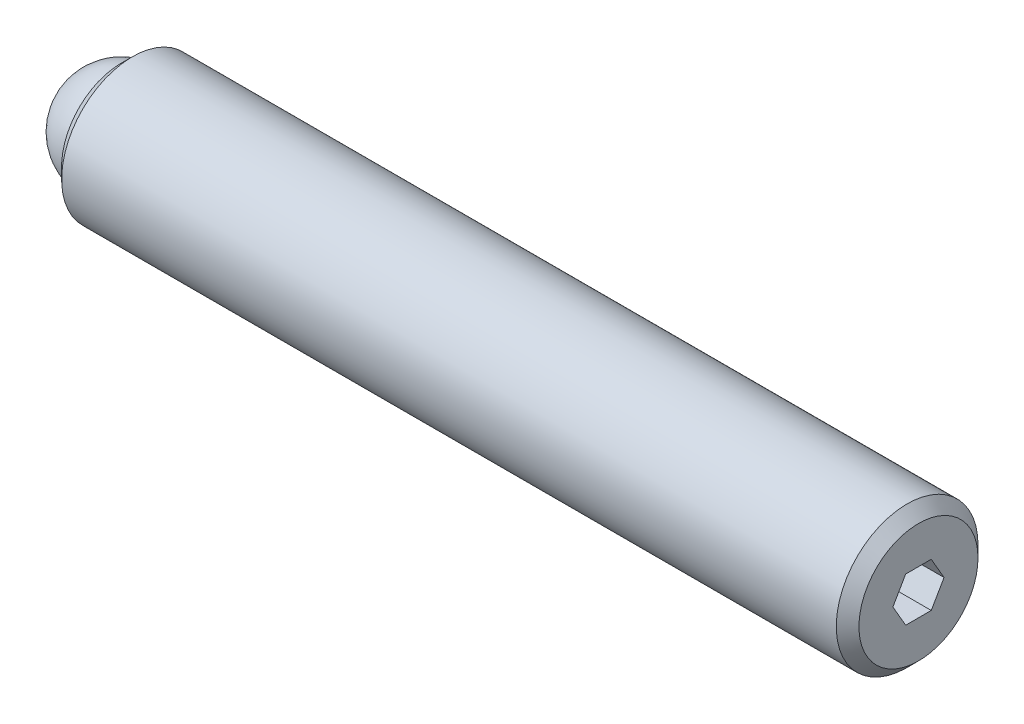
ISO-10303-21;
HEADER;
FILE_DESCRIPTION(('STEP AP214'),'2;1');
FILE_NAME('part.step','',(''),(''),'','','');
FILE_SCHEMA(('AUTOMOTIVE_DESIGN { 1 0 10303 214 1 1 1 1 }'));
ENDSEC;
DATA;
#1=APPLICATION_CONTEXT('core data for automotive mechanical design processes');
#2=APPLICATION_PROTOCOL_DEFINITION('international standard','automotive_design',2000,#1);
#3=PRODUCT_CONTEXT('',#1,'mechanical');
#4=PRODUCT('Part','Part','',(#3));
#5=PRODUCT_RELATED_PRODUCT_CATEGORY('part','',(#4));
#6=PRODUCT_DEFINITION_FORMATION('','',#4);
#7=PRODUCT_DEFINITION_CONTEXT('part definition',#1,'design');
#8=PRODUCT_DEFINITION('design','',#6,#7);
#9=PRODUCT_DEFINITION_SHAPE('','',#8);
#10=(LENGTH_UNIT() NAMED_UNIT(*) SI_UNIT(.MILLI.,.METRE.));
#11=(NAMED_UNIT(*) PLANE_ANGLE_UNIT() SI_UNIT($,.RADIAN.));
#12=(NAMED_UNIT(*) SI_UNIT($,.STERADIAN.) SOLID_ANGLE_UNIT());
#13=UNCERTAINTY_MEASURE_WITH_UNIT(LENGTH_MEASURE(1.E-05),#10,'distance_accuracy_value','');
#14=(GEOMETRIC_REPRESENTATION_CONTEXT(3) GLOBAL_UNCERTAINTY_ASSIGNED_CONTEXT((#13)) GLOBAL_UNIT_ASSIGNED_CONTEXT((#10,
#11,#12)) REPRESENTATION_CONTEXT('',''));
#15=CARTESIAN_POINT('',(0.,0.,0.));
#16=DIRECTION('',(0.,0.,1.));
#17=DIRECTION('',(1.,0.,0.));
#18=AXIS2_PLACEMENT_3D('',#15,#16,#17);
#19=CARTESIAN_POINT('',(0.,0.,0.));
#20=DIRECTION('',(0.,-1.,0.));
#21=DIRECTION('',(0.,0.,1.));
#22=AXIS2_PLACEMENT_3D('',#19,#20,#21);
#23=SPHERICAL_SURFACE('',#22,2.38125);
#24=CARTESIAN_POINT('',(0.,-2.38125,0.));
#25=VERTEX_POINT('',#24);
#26=VERTEX_LOOP('',#25);
#27=FACE_BOUND('',#26,.T.);
#28=ADVANCED_FACE('F41',(#27),#23,.T.);
#29=CLOSED_SHELL('',(#28));
#30=MANIFOLD_SOLID_BREP('B2',#29);
#31=CARTESIAN_POINT('',(35.71875,0.,0.));
#32=DIRECTION('',(-1.,0.,0.));
#33=DIRECTION('',(0.,0.,1.));
#34=AXIS2_PLACEMENT_3D('',#31,#32,#33);
#35=CYLINDRICAL_SURFACE('',#34,3.175);
#36=CARTESIAN_POINT('',(35.21075,0.,0.));
#37=DIRECTION('',(1.,0.,0.));
#38=DIRECTION('',(0.,0.,-1.));
#39=AXIS2_PLACEMENT_3D('',#36,#37,#38);
#40=CIRCLE('',#39,3.175);
#41=CARTESIAN_POINT('',(35.21075,0.,-3.175));
#42=VERTEX_POINT('',#41);
#43=EDGE_CURVE('E39',#42,#42,#40,.F.);
#44=ORIENTED_EDGE('',*,*,#43,.T.);
#45=EDGE_LOOP('',(#44));
#46=FACE_BOUND('',#45,.T.);
#47=CARTESIAN_POINT('',(0.508000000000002,0.,0.));
#48=DIRECTION('',(1.,0.,0.));
#49=DIRECTION('',(0.,0.,-1.));
#50=AXIS2_PLACEMENT_3D('',#47,#48,#49);
#51=CIRCLE('',#50,3.175);
#52=CARTESIAN_POINT('',(0.508000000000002,0.,-3.175));
#53=VERTEX_POINT('',#52);
#54=EDGE_CURVE('E176',#53,#53,#51,.T.);
#55=ORIENTED_EDGE('',*,*,#54,.T.);
#56=EDGE_LOOP('',(#55));
#57=FACE_BOUND('',#56,.T.);
#58=ADVANCED_FACE('F54',(#46,#57),#35,.T.);
#59=CARTESIAN_POINT('',(35.71875,0.,0.));
#60=DIRECTION('',(1.,0.,0.));
#61=DIRECTION('',(0.,0.,-1.));
#62=AXIS2_PLACEMENT_3D('',#59,#60,#61);
#63=PLANE('',#62);
#64=DIRECTION('',(0.,0.866025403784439,-0.5));
#65=VECTOR('',#64,1.);
#66=CARTESIAN_POINT('',(35.71875,-0.9921875,-0.572839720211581));
#67=LINE('',#66,#65);
#68=CARTESIAN_POINT('',(35.71875,-0.9921875,-0.572839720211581));
#69=VERTEX_POINT('',#68);
#70=CARTESIAN_POINT('',(35.71875,0.,-1.14567944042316));
#71=VERTEX_POINT('',#70);
#72=EDGE_CURVE('E77',#69,#71,#67,.T.);
#73=ORIENTED_EDGE('',*,*,#72,.F.);
#74=DIRECTION('',(0.,0.,-1.));
#75=VECTOR('',#74,1.);
#76=CARTESIAN_POINT('',(35.71875,-0.9921875,0.572839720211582));
#77=LINE('',#76,#75);
#78=CARTESIAN_POINT('',(35.71875,-0.9921875,0.572839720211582));
#79=VERTEX_POINT('',#78);
#80=EDGE_CURVE('E143',#79,#69,#77,.T.);
#81=ORIENTED_EDGE('',*,*,#80,.F.);
#82=DIRECTION('',(0.,-0.866025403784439,-0.5));
#83=VECTOR('',#82,1.);
#84=CARTESIAN_POINT('',(35.71875,0.,1.14567944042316));
#85=LINE('',#84,#83);
#86=CARTESIAN_POINT('',(35.71875,0.,1.14567944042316));
#87=VERTEX_POINT('',#86);
#88=EDGE_CURVE('E169',#87,#79,#85,.T.);
#89=ORIENTED_EDGE('',*,*,#88,.F.);
#90=DIRECTION('',(0.,-0.866025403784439,0.5));
#91=VECTOR('',#90,1.);
#92=CARTESIAN_POINT('',(35.71875,0.992187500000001,0.572839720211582));
#93=LINE('',#92,#91);
#94=CARTESIAN_POINT('',(35.71875,0.992187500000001,0.572839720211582));
#95=VERTEX_POINT('',#94);
#96=EDGE_CURVE('E166',#95,#87,#93,.T.);
#97=ORIENTED_EDGE('',*,*,#96,.F.);
#98=DIRECTION('',(0.,0.,1.));
#99=VECTOR('',#98,1.);
#100=CARTESIAN_POINT('',(35.71875,0.9921875,-0.572839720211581));
#101=LINE('',#100,#99);
#102=CARTESIAN_POINT('',(35.71875,0.9921875,-0.572839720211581));
#103=VERTEX_POINT('',#102);
#104=EDGE_CURVE('E163',#103,#95,#101,.T.);
#105=ORIENTED_EDGE('',*,*,#104,.F.);
#106=DIRECTION('',(0.,0.866025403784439,0.5));
#107=VECTOR('',#106,1.);
#108=CARTESIAN_POINT('',(35.71875,0.,-1.14567944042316));
#109=LINE('',#108,#107);
#110=EDGE_CURVE('E160',#71,#103,#109,.T.);
#111=ORIENTED_EDGE('',*,*,#110,.F.);
#112=EDGE_LOOP('',(#73,#81,#89,#97,#105,#111));
#113=FACE_BOUND('',#112,.T.);
#114=CARTESIAN_POINT('',(35.71875,0.,0.));
#115=DIRECTION('',(1.,0.,0.));
#116=DIRECTION('',(0.,0.,-1.));
#117=AXIS2_PLACEMENT_3D('',#114,#115,#116);
#118=CIRCLE('',#117,2.66699999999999);
#119=CARTESIAN_POINT('',(35.71875,0.,-2.66699999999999));
#120=VERTEX_POINT('',#119);
#121=EDGE_CURVE('E62',#120,#120,#118,.T.);
#122=ORIENTED_EDGE('',*,*,#121,.T.);
#123=EDGE_LOOP('',(#122));
#124=FACE_BOUND('',#123,.T.);
#125=ADVANCED_FACE('F193',(#113,#124),#63,.T.);
#126=CARTESIAN_POINT('',(0.,0.,0.));
#127=DIRECTION('',(1.,0.,0.));
#128=DIRECTION('',(0.,0.,-1.));
#129=AXIS2_PLACEMENT_3D('',#126,#127,#128);
#130=PLANE('',#129);
#131=CARTESIAN_POINT('',(0.,0.,0.));
#132=DIRECTION('',(-1.,0.,0.));
#133=DIRECTION('',(0.,0.,1.));
#134=AXIS2_PLACEMENT_3D('',#131,#132,#133);
#135=CIRCLE('',#134,2.38125);
#136=CARTESIAN_POINT('',(0.,2.38040333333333,-0.0634943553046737));
#137=VERTEX_POINT('',#136);
#138=CARTESIAN_POINT('',(0.,2.38040333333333,0.0634943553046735));
#139=VERTEX_POINT('',#138);
#140=EDGE_CURVE('E128',#137,#139,#135,.T.);
#141=ORIENTED_EDGE('',*,*,#140,.F.);
#142=CARTESIAN_POINT('',(0.,2.38125,0.));
#143=DIRECTION('',(-1.,0.,0.));
#144=DIRECTION('',(0.,0.,1.));
#145=AXIS2_PLACEMENT_3D('',#142,#143,#144);
#146=CIRCLE('',#145,0.0635000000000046);
#147=EDGE_CURVE('E117',#139,#137,#146,.T.);
#148=ORIENTED_EDGE('',*,*,#147,.F.);
#149=EDGE_LOOP('',(#141,#148));
#150=FACE_BOUND('',#149,.T.);
#151=CARTESIAN_POINT('',(0.,0.,0.));
#152=DIRECTION('',(1.,0.,0.));
#153=DIRECTION('',(0.,0.,-1.));
#154=AXIS2_PLACEMENT_3D('',#151,#152,#153);
#155=CIRCLE('',#154,2.667);
#156=CARTESIAN_POINT('',(0.,0.,-2.667));
#157=VERTEX_POINT('',#156);
#158=EDGE_CURVE('E188',#157,#157,#155,.F.);
#159=ORIENTED_EDGE('',*,*,#158,.T.);
#160=EDGE_LOOP('',(#159));
#161=FACE_BOUND('',#160,.T.);
#162=ADVANCED_FACE('F132',(#150,#161),#130,.F.);
#163=CARTESIAN_POINT('',(0.508000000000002,0.,0.));
#164=DIRECTION('',(1.,0.,0.));
#165=DIRECTION('',(0.,0.,-1.));
#166=AXIS2_PLACEMENT_3D('',#163,#164,#165);
#167=CONICAL_SURFACE('',#166,3.175,0.785398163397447);
#168=ORIENTED_EDGE('',*,*,#158,.F.);
#169=EDGE_LOOP('',(#168));
#170=FACE_BOUND('',#169,.T.);
#171=ORIENTED_EDGE('',*,*,#54,.F.);
#172=EDGE_LOOP('',(#171));
#173=FACE_BOUND('',#172,.T.);
#174=ADVANCED_FACE('F197',(#170,#173),#167,.T.);
#175=CARTESIAN_POINT('',(35.71875,0.,0.));
#176=DIRECTION('',(-1.,0.,0.));
#177=DIRECTION('',(0.,0.,1.));
#178=AXIS2_PLACEMENT_3D('',#175,#176,#177);
#179=CONICAL_SURFACE('',#178,2.66699999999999,0.785398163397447);
#180=ORIENTED_EDGE('',*,*,#43,.F.);
#181=EDGE_LOOP('',(#180));
#182=FACE_BOUND('',#181,.T.);
#183=ORIENTED_EDGE('',*,*,#121,.F.);
#184=EDGE_LOOP('',(#183));
#185=FACE_BOUND('',#184,.T.);
#186=ADVANCED_FACE('F56',(#182,#185),#179,.T.);
#187=CARTESIAN_POINT('',(33.43275,-0.9921875,-0.572839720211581));
#188=DIRECTION('',(0.,-0.5,-0.866025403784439));
#189=DIRECTION('',(0.,0.866025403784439,-0.5));
#190=AXIS2_PLACEMENT_3D('',#187,#188,#189);
#191=PLANE('',#190);
#192=ORIENTED_EDGE('',*,*,#72,.T.);
#193=DIRECTION('',(1.,0.,0.));
#194=VECTOR('',#193,1.);
#195=CARTESIAN_POINT('',(33.43275,0.,-1.14567944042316));
#196=LINE('',#195,#194);
#197=CARTESIAN_POINT('',(33.43275,0.,-1.14567944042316));
#198=VERTEX_POINT('',#197);
#199=EDGE_CURVE('E158',#198,#71,#196,.T.);
#200=ORIENTED_EDGE('',*,*,#199,.F.);
#201=DIRECTION('',(0.,0.866025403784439,-0.5));
#202=VECTOR('',#201,1.);
#203=CARTESIAN_POINT('',(33.43275,-0.9921875,-0.572839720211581));
#204=LINE('',#203,#202);
#205=CARTESIAN_POINT('',(33.43275,-0.9921875,-0.572839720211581));
#206=VERTEX_POINT('',#205);
#207=EDGE_CURVE('E139',#206,#198,#204,.T.);
#208=ORIENTED_EDGE('',*,*,#207,.F.);
#209=DIRECTION('',(1.,0.,0.));
#210=VECTOR('',#209,1.);
#211=CARTESIAN_POINT('',(33.43275,-0.9921875,-0.572839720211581));
#212=LINE('',#211,#210);
#213=EDGE_CURVE('E174',#206,#69,#212,.T.);
#214=ORIENTED_EDGE('',*,*,#213,.T.);
#215=EDGE_LOOP('',(#192,#200,#208,#214));
#216=FACE_BOUND('',#215,.T.);
#217=ADVANCED_FACE('F196',(#216),#191,.F.);
#218=CARTESIAN_POINT('',(33.43275,-0.9921875,0.572839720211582));
#219=DIRECTION('',(0.,-1.,0.));
#220=DIRECTION('',(0.,0.,-1.));
#221=AXIS2_PLACEMENT_3D('',#218,#219,#220);
#222=PLANE('',#221);
#223=ORIENTED_EDGE('',*,*,#80,.T.);
#224=ORIENTED_EDGE('',*,*,#213,.F.);
#225=DIRECTION('',(0.,0.,-1.));
#226=VECTOR('',#225,1.);
#227=CARTESIAN_POINT('',(33.43275,-0.9921875,0.572839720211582));
#228=LINE('',#227,#226);
#229=CARTESIAN_POINT('',(33.43275,-0.9921875,0.572839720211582));
#230=VERTEX_POINT('',#229);
#231=EDGE_CURVE('E155',#230,#206,#228,.T.);
#232=ORIENTED_EDGE('',*,*,#231,.F.);
#233=DIRECTION('',(1.,0.,0.));
#234=VECTOR('',#233,1.);
#235=CARTESIAN_POINT('',(33.43275,-0.9921875,0.572839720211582));
#236=LINE('',#235,#234);
#237=EDGE_CURVE('E177',#230,#79,#236,.T.);
#238=ORIENTED_EDGE('',*,*,#237,.T.);
#239=EDGE_LOOP('',(#223,#224,#232,#238));
#240=FACE_BOUND('',#239,.T.);
#241=ADVANCED_FACE('F203',(#240),#222,.F.);
#242=CARTESIAN_POINT('',(33.43275,0.,1.14567944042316));
#243=DIRECTION('',(0.,-0.5,0.866025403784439));
#244=DIRECTION('',(0.,-0.866025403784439,-0.5));
#245=AXIS2_PLACEMENT_3D('',#242,#243,#244);
#246=PLANE('',#245);
#247=ORIENTED_EDGE('',*,*,#88,.T.);
#248=ORIENTED_EDGE('',*,*,#237,.F.);
#249=DIRECTION('',(0.,-0.866025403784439,-0.5));
#250=VECTOR('',#249,1.);
#251=CARTESIAN_POINT('',(33.43275,0.,1.14567944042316));
#252=LINE('',#251,#250);
#253=CARTESIAN_POINT('',(33.43275,0.,1.14567944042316));
#254=VERTEX_POINT('',#253);
#255=EDGE_CURVE('E152',#254,#230,#252,.T.);
#256=ORIENTED_EDGE('',*,*,#255,.F.);
#257=DIRECTION('',(1.,0.,0.));
#258=VECTOR('',#257,1.);
#259=CARTESIAN_POINT('',(33.43275,0.,1.14567944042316));
#260=LINE('',#259,#258);
#261=EDGE_CURVE('E179',#254,#87,#260,.T.);
#262=ORIENTED_EDGE('',*,*,#261,.T.);
#263=EDGE_LOOP('',(#247,#248,#256,#262));
#264=FACE_BOUND('',#263,.T.);
#265=ADVANCED_FACE('F231',(#264),#246,.F.);
#266=CARTESIAN_POINT('',(33.43275,0.992187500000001,0.572839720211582));
#267=DIRECTION('',(0.,0.5,0.866025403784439));
#268=DIRECTION('',(0.,-0.866025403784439,0.5));
#269=AXIS2_PLACEMENT_3D('',#266,#267,#268);
#270=PLANE('',#269);
#271=ORIENTED_EDGE('',*,*,#96,.T.);
#272=ORIENTED_EDGE('',*,*,#261,.F.);
#273=DIRECTION('',(0.,-0.866025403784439,0.5));
#274=VECTOR('',#273,1.);
#275=CARTESIAN_POINT('',(33.43275,0.992187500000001,0.572839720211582));
#276=LINE('',#275,#274);
#277=CARTESIAN_POINT('',(33.43275,0.992187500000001,0.572839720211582));
#278=VERTEX_POINT('',#277);
#279=EDGE_CURVE('E149',#278,#254,#276,.T.);
#280=ORIENTED_EDGE('',*,*,#279,.F.);
#281=DIRECTION('',(1.,0.,0.));
#282=VECTOR('',#281,1.);
#283=CARTESIAN_POINT('',(33.43275,0.992187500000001,0.572839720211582));
#284=LINE('',#283,#282);
#285=EDGE_CURVE('E181',#278,#95,#284,.T.);
#286=ORIENTED_EDGE('',*,*,#285,.T.);
#287=EDGE_LOOP('',(#271,#272,#280,#286));
#288=FACE_BOUND('',#287,.T.);
#289=ADVANCED_FACE('F227',(#288),#270,.F.);
#290=CARTESIAN_POINT('',(33.43275,0.9921875,-0.572839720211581));
#291=DIRECTION('',(0.,1.,0.));
#292=DIRECTION('',(0.,0.,1.));
#293=AXIS2_PLACEMENT_3D('',#290,#291,#292);
#294=PLANE('',#293);
#295=ORIENTED_EDGE('',*,*,#104,.T.);
#296=ORIENTED_EDGE('',*,*,#285,.F.);
#297=DIRECTION('',(0.,0.,1.));
#298=VECTOR('',#297,1.);
#299=CARTESIAN_POINT('',(33.43275,0.9921875,-0.572839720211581));
#300=LINE('',#299,#298);
#301=CARTESIAN_POINT('',(33.43275,0.9921875,-0.572839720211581));
#302=VERTEX_POINT('',#301);
#303=EDGE_CURVE('E146',#302,#278,#300,.T.);
#304=ORIENTED_EDGE('',*,*,#303,.F.);
#305=DIRECTION('',(1.,0.,0.));
#306=VECTOR('',#305,1.);
#307=CARTESIAN_POINT('',(33.43275,0.9921875,-0.572839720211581));
#308=LINE('',#307,#306);
#309=EDGE_CURVE('E183',#302,#103,#308,.T.);
#310=ORIENTED_EDGE('',*,*,#309,.T.);
#311=EDGE_LOOP('',(#295,#296,#304,#310));
#312=FACE_BOUND('',#311,.T.);
#313=ADVANCED_FACE('F223',(#312),#294,.F.);
#314=CARTESIAN_POINT('',(33.43275,0.,-1.14567944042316));
#315=DIRECTION('',(0.,0.5,-0.866025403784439));
#316=DIRECTION('',(0.,0.866025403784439,0.5));
#317=AXIS2_PLACEMENT_3D('',#314,#315,#316);
#318=PLANE('',#317);
#319=ORIENTED_EDGE('',*,*,#110,.T.);
#320=ORIENTED_EDGE('',*,*,#309,.F.);
#321=DIRECTION('',(0.,0.866025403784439,0.5));
#322=VECTOR('',#321,1.);
#323=CARTESIAN_POINT('',(33.43275,0.,-1.14567944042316));
#324=LINE('',#323,#322);
#325=EDGE_CURVE('E142',#198,#302,#324,.T.);
#326=ORIENTED_EDGE('',*,*,#325,.F.);
#327=ORIENTED_EDGE('',*,*,#199,.T.);
#328=EDGE_LOOP('',(#319,#320,#326,#327));
#329=FACE_BOUND('',#328,.T.);
#330=ADVANCED_FACE('F219',(#329),#318,.F.);
#331=CARTESIAN_POINT('',(33.43275,0.,0.));
#332=DIRECTION('',(1.,0.,0.));
#333=DIRECTION('',(0.,0.,-1.));
#334=AXIS2_PLACEMENT_3D('',#331,#332,#333);
#335=PLANE('',#334);
#336=ORIENTED_EDGE('',*,*,#207,.T.);
#337=ORIENTED_EDGE('',*,*,#325,.T.);
#338=ORIENTED_EDGE('',*,*,#303,.T.);
#339=ORIENTED_EDGE('',*,*,#279,.T.);
#340=ORIENTED_EDGE('',*,*,#255,.T.);
#341=ORIENTED_EDGE('',*,*,#231,.T.);
#342=EDGE_LOOP('',(#336,#337,#338,#339,#340,#341));
#343=FACE_BOUND('',#342,.T.);
#344=ADVANCED_FACE('F222',(#343),#335,.T.);
#345=CARTESIAN_POINT('',(2.38125,0.,0.));
#346=DIRECTION('',(-1.,0.,0.));
#347=DIRECTION('',(0.,0.,1.));
#348=AXIS2_PLACEMENT_3D('',#345,#346,#347);
#349=CYLINDRICAL_SURFACE('',#348,2.38125);
#350=CARTESIAN_POINT('',(2.38125,0.,0.));
#351=DIRECTION('',(-1.,0.,0.));
#352=DIRECTION('',(0.,0.,1.));
#353=AXIS2_PLACEMENT_3D('',#350,#351,#352);
#354=CIRCLE('',#353,2.38125);
#355=CARTESIAN_POINT('',(2.38125,2.38040333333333,-0.0634943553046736));
#356=VERTEX_POINT('',#355);
#357=CARTESIAN_POINT('',(2.38125,2.38040333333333,0.0634943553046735));
#358=VERTEX_POINT('',#357);
#359=EDGE_CURVE('E130',#356,#358,#354,.T.);
#360=ORIENTED_EDGE('',*,*,#359,.F.);
#361=DIRECTION('',(-1.,0.,0.));
#362=VECTOR('',#361,1.);
#363=CARTESIAN_POINT('',(2.52362097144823,2.38040333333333,-0.0634943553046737));
#364=LINE('',#363,#362);
#365=EDGE_CURVE('E69',#356,#137,#364,.T.);
#366=ORIENTED_EDGE('',*,*,#365,.T.);
#367=ORIENTED_EDGE('',*,*,#140,.T.);
#368=DIRECTION('',(-1.,0.,0.));
#369=VECTOR('',#368,1.);
#370=CARTESIAN_POINT('',(2.52362097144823,2.38040333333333,0.0634943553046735));
#371=LINE('',#370,#369);
#372=EDGE_CURVE('E120',#358,#139,#371,.T.);
#373=ORIENTED_EDGE('',*,*,#372,.F.);
#374=EDGE_LOOP('',(#360,#366,#367,#373));
#375=FACE_BOUND('',#374,.T.);
#376=ADVANCED_FACE('F127',(#375),#349,.F.);
#377=CARTESIAN_POINT('',(2.38125,0.,0.));
#378=DIRECTION('',(-1.,0.,0.));
#379=DIRECTION('',(0.,0.,1.));
#380=AXIS2_PLACEMENT_3D('',#377,#378,#379);
#381=PLANE('',#380);
#382=ORIENTED_EDGE('',*,*,#359,.T.);
#383=CARTESIAN_POINT('',(2.38125,2.38125,0.));
#384=DIRECTION('',(-1.,0.,0.));
#385=DIRECTION('',(0.,0.,1.));
#386=AXIS2_PLACEMENT_3D('',#383,#384,#385);
#387=CIRCLE('',#386,0.0635000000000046);
#388=EDGE_CURVE('E134',#356,#358,#387,.F.);
#389=ORIENTED_EDGE('',*,*,#388,.F.);
#390=EDGE_LOOP('',(#382,#389));
#391=FACE_BOUND('',#390,.T.);
#392=ADVANCED_FACE('F244',(#391),#381,.T.);
#393=CARTESIAN_POINT('',(2.52362097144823,2.38125,0.));
#394=DIRECTION('',(-1.,0.,0.));
#395=DIRECTION('',(0.,0.,1.));
#396=AXIS2_PLACEMENT_3D('',#393,#394,#395);
#397=CYLINDRICAL_SURFACE('',#396,0.0635000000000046);
#398=ORIENTED_EDGE('',*,*,#388,.T.);
#399=ORIENTED_EDGE('',*,*,#372,.T.);
#400=ORIENTED_EDGE('',*,*,#147,.T.);
#401=ORIENTED_EDGE('',*,*,#365,.F.);
#402=EDGE_LOOP('',(#398,#399,#400,#401));
#403=FACE_BOUND('',#402,.T.);
#404=ADVANCED_FACE('F118',(#403),#397,.F.);
#405=CLOSED_SHELL('',(#58,#125,#162,#174,#186,#217,#241,#265,#289,#313,#330,#344,#376,#392,#404));
#406=MANIFOLD_SOLID_BREP('B6',#405);
#407=ADVANCED_BREP_SHAPE_REPRESENTATION('',(#18,#30,#406),#14);
#408=SHAPE_DEFINITION_REPRESENTATION(#9,#407);
ENDSEC;
END-ISO-10303-21;
